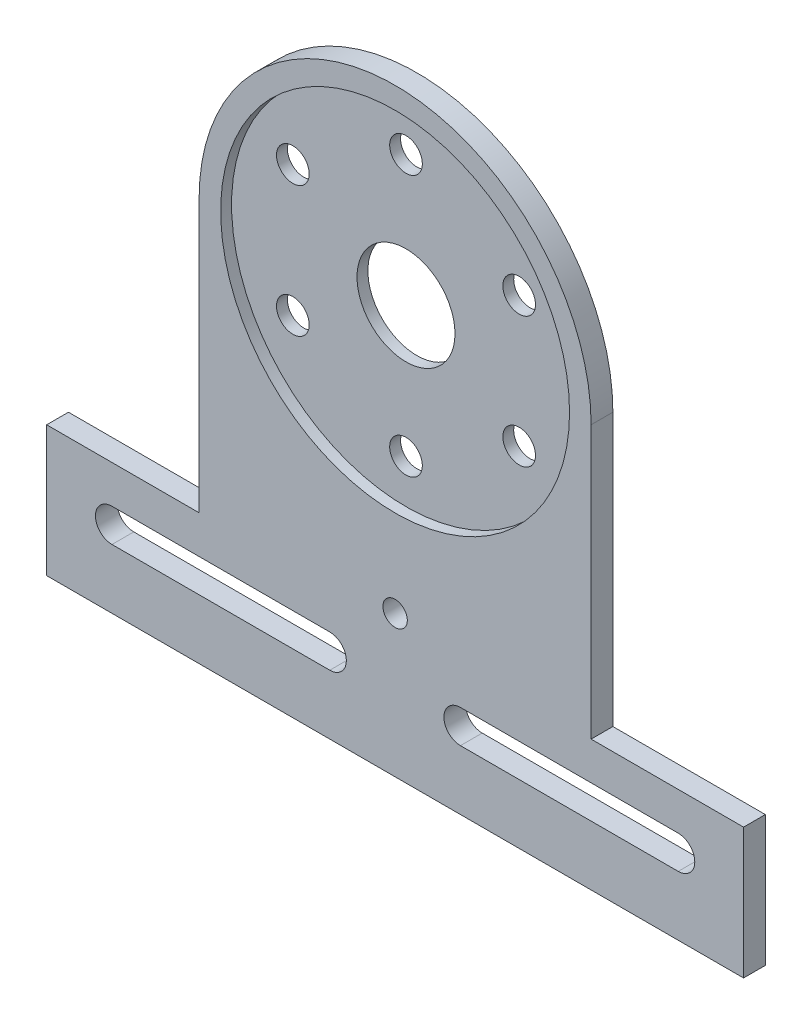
from build123d import *

# Parameters (mm, degrees)
SKETCH1_R          = 14.2875
EXTRUDE1_DEPTH     = 6.35
SKETCH2_R          = 50.8635
CUT_EXTRUDE1_DEPTH = 3.175
SKETCH3_R          = 4.7625
CUT_EXTRUDE2_DEPTH = 156.348048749
CIRPATTERN1_COUNT  = 6
CUT_EXTRUDE3_DEPTH = 156.445354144
SKETCH5_R          = 3.556
CUT_EXTRUDE4_DEPTH = 156.445354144


with BuildPart() as part:
    # Sketch1 → Extrude1 (new body)
    with BuildSketch(Plane.XY):
        with BuildLine():
            Line((57.15, 0), (57.15, -79.375))
            Line((57.15, -79.375), (101.6, -79.375))
            Line((101.6, -79.375), (101.6, -117.475))
            Line((101.6, -117.475), (-101.6, -117.475))
            Line((-101.6, -117.475), (-101.6, -79.375))
            Line((-101.6, -79.375), (-57.15, -79.375))
            Line((-57.15, -79.375), (-57.15, 0))
            ThreePointArc((-57.15, 0), (0, 57.15), (57.15, 0))
        make_face()
        Circle(SKETCH1_R, mode=Mode.SUBTRACT)
    extrude(amount=EXTRUDE1_DEPTH)

    # Sketch2 → Cut-Extrude1 (cut)
    with BuildSketch(Plane.XY.offset(6.35)):
        Circle(SKETCH2_R)
    extrude(amount=-CUT_EXTRUDE1_DEPTH, mode=Mode.SUBTRACT)

    # Sketch3 → Cut-Extrude2 (cut, through all)
    with BuildSketch(Plane.XY.offset(3.175)):
        with Locations((0, 38.1)):
            Circle(SKETCH3_R)
    cut_extrude2 = extrude(amount=-CUT_EXTRUDE2_DEPTH, mode=Mode.SUBTRACT)

    # CirPattern1: Cut-Extrude2 ×6 about axis
    cirpattern1_axis = Axis((0, 0, 0), (0, 0, 1))
    for i in range(1, CIRPATTERN1_COUNT):
        add(cut_extrude2.rotate(cirpattern1_axis, i * 360 / CIRPATTERN1_COUNT), mode=Mode.SUBTRACT)

    # Sketch4 → Cut-Extrude3 (cut, through all)
    with BuildSketch(Plane.XY.offset(6.35)):
        with BuildLine():
            Line((-82.55, -100.076), (-19.05, -100.076))
            ThreePointArc((-19.05, -100.076), (-14.224, -95.25), (-19.05, -90.424))
            Line((-19.05, -90.424), (-82.55, -90.424))
            ThreePointArc((-82.55, -90.424), (-87.376, -95.25), (-82.55, -100.076))
        make_face()
    cut_extrude3 = extrude(amount=-CUT_EXTRUDE3_DEPTH, mode=Mode.SUBTRACT)

    # Mirror1: Cut-Extrude3 across plane
    add(cut_extrude3.mirror(Plane(origin=(0, 0, 0), x_dir=(0, 0, 1), z_dir=(1, 0, 0))), mode=Mode.SUBTRACT)

    # Sketch5 → Cut-Extrude4 (cut, through all)
    with BuildSketch(Plane(origin=(0, 0, 0), x_dir=(-1, 0, 0), z_dir=(0, 0, -1))):
        with Locations((0, -76.2)):
            Circle(SKETCH5_R)
    extrude(amount=-CUT_EXTRUDE4_DEPTH, mode=Mode.SUBTRACT)


solid = part.part
